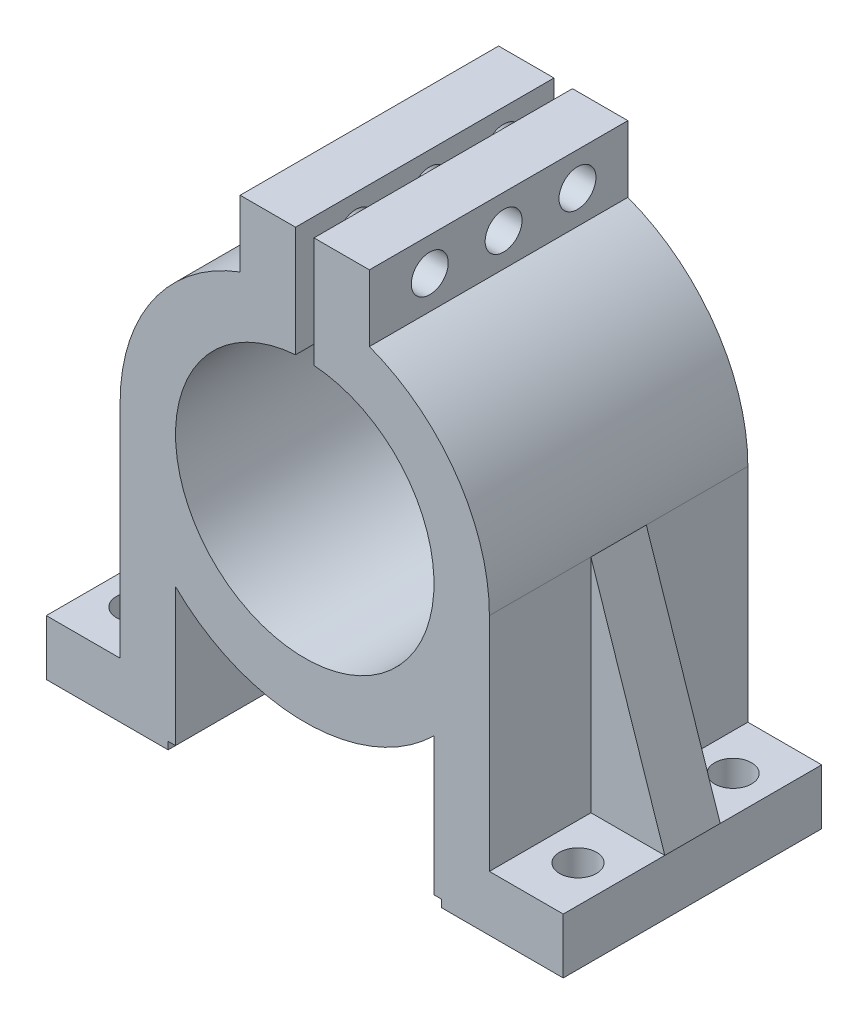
ISO-10303-21;
HEADER;
FILE_DESCRIPTION(('STEP AP214'),'2;1');
FILE_NAME('part.step','',(''),(''),'','','');
FILE_SCHEMA(('AUTOMOTIVE_DESIGN { 1 0 10303 214 1 1 1 1 }'));
ENDSEC;
DATA;
#1=APPLICATION_CONTEXT('core data for automotive mechanical design processes');
#2=APPLICATION_PROTOCOL_DEFINITION('international standard','automotive_design',2000,#1);
#3=PRODUCT_CONTEXT('',#1,'mechanical');
#4=PRODUCT('Part','Part','',(#3));
#5=PRODUCT_RELATED_PRODUCT_CATEGORY('part','',(#4));
#6=PRODUCT_DEFINITION_FORMATION('','',#4);
#7=PRODUCT_DEFINITION_CONTEXT('part definition',#1,'design');
#8=PRODUCT_DEFINITION('design','',#6,#7);
#9=PRODUCT_DEFINITION_SHAPE('','',#8);
#10=(LENGTH_UNIT() NAMED_UNIT(*) SI_UNIT(.MILLI.,.METRE.));
#11=(NAMED_UNIT(*) PLANE_ANGLE_UNIT() SI_UNIT($,.RADIAN.));
#12=(NAMED_UNIT(*) SI_UNIT($,.STERADIAN.) SOLID_ANGLE_UNIT());
#13=UNCERTAINTY_MEASURE_WITH_UNIT(LENGTH_MEASURE(1.E-05),#10,'distance_accuracy_value','');
#14=(GEOMETRIC_REPRESENTATION_CONTEXT(3) GLOBAL_UNCERTAINTY_ASSIGNED_CONTEXT((#13)) GLOBAL_UNIT_ASSIGNED_CONTEXT((#10,
#11,#12)) REPRESENTATION_CONTEXT('',''));
#15=CARTESIAN_POINT('',(0.,0.,0.));
#16=DIRECTION('',(0.,0.,1.));
#17=DIRECTION('',(1.,0.,0.));
#18=AXIS2_PLACEMENT_3D('',#15,#16,#17);
#19=CARTESIAN_POINT('',(10.,-12.,7.));
#20=DIRECTION('',(0.,-1.,0.));
#21=DIRECTION('',(0.,0.,-1.));
#22=AXIS2_PLACEMENT_3D('',#19,#20,#21);
#23=PLANE('',#22);
#24=CARTESIAN_POINT('',(12.,-12.,4.2));
#25=DIRECTION('',(0.,1.,0.));
#26=DIRECTION('',(0.,0.,-1.));
#27=AXIS2_PLACEMENT_3D('',#24,#25,#26);
#28=CIRCLE('',#27,1.);
#29=CARTESIAN_POINT('',(12.,-12.,3.2));
#30=VERTEX_POINT('',#29);
#31=EDGE_CURVE('E353',#30,#30,#28,.T.);
#32=ORIENTED_EDGE('',*,*,#31,.F.);
#33=EDGE_LOOP('',(#32));
#34=FACE_BOUND('',#33,.T.);
#35=DIRECTION('',(-1.,0.,0.));
#36=VECTOR('',#35,1.);
#37=CARTESIAN_POINT('',(10.,-12.,1.5));
#38=LINE('',#37,#36);
#39=CARTESIAN_POINT('',(14.,-12.,1.5));
#40=VERTEX_POINT('',#39);
#41=CARTESIAN_POINT('',(10.,-12.,1.5));
#42=VERTEX_POINT('',#41);
#43=EDGE_CURVE('E241',#40,#42,#38,.T.);
#44=ORIENTED_EDGE('',*,*,#43,.T.);
#45=DIRECTION('',(0.,0.,-1.));
#46=VECTOR('',#45,1.);
#47=CARTESIAN_POINT('',(10.,-12.,7.));
#48=LINE('',#47,#46);
#49=CARTESIAN_POINT('',(10.,-12.,7.));
#50=VERTEX_POINT('',#49);
#51=EDGE_CURVE('E253',#50,#42,#48,.T.);
#52=ORIENTED_EDGE('',*,*,#51,.F.);
#53=DIRECTION('',(-1.,0.,0.));
#54=VECTOR('',#53,1.);
#55=CARTESIAN_POINT('',(10.,-12.,7.));
#56=LINE('',#55,#54);
#57=CARTESIAN_POINT('',(14.,-12.,7.));
#58=VERTEX_POINT('',#57);
#59=EDGE_CURVE('E450',#58,#50,#56,.T.);
#60=ORIENTED_EDGE('',*,*,#59,.F.);
#61=DIRECTION('',(0.,0.,-1.));
#62=VECTOR('',#61,1.);
#63=CARTESIAN_POINT('',(14.,-12.,7.));
#64=LINE('',#63,#62);
#65=EDGE_CURVE('E256',#58,#40,#64,.T.);
#66=ORIENTED_EDGE('',*,*,#65,.T.);
#67=EDGE_LOOP('',(#44,#52,#60,#66));
#68=FACE_BOUND('',#67,.T.);
#69=ADVANCED_FACE('F39',(#34,#68),#23,.F.);
#70=CARTESIAN_POINT('',(10.,0.,7.));
#71=DIRECTION('',(-1.,0.,0.));
#72=DIRECTION('',(0.,0.,1.));
#73=AXIS2_PLACEMENT_3D('',#70,#71,#72);
#74=PLANE('',#73);
#75=DIRECTION('',(0.,1.,0.));
#76=VECTOR('',#75,1.);
#77=CARTESIAN_POINT('',(10.,0.,1.5));
#78=LINE('',#77,#76);
#79=CARTESIAN_POINT('',(10.,0.,1.5));
#80=VERTEX_POINT('',#79);
#81=EDGE_CURVE('E238',#42,#80,#78,.T.);
#82=ORIENTED_EDGE('',*,*,#81,.T.);
#83=DIRECTION('',(0.,0.,-1.));
#84=VECTOR('',#83,1.);
#85=CARTESIAN_POINT('',(10.,0.,7.));
#86=LINE('',#85,#84);
#87=CARTESIAN_POINT('',(10.,0.,7.));
#88=VERTEX_POINT('',#87);
#89=EDGE_CURVE('E264',#88,#80,#86,.T.);
#90=ORIENTED_EDGE('',*,*,#89,.F.);
#91=DIRECTION('',(0.,1.,0.));
#92=VECTOR('',#91,1.);
#93=CARTESIAN_POINT('',(10.,0.,7.));
#94=LINE('',#93,#92);
#95=EDGE_CURVE('E259',#50,#88,#94,.T.);
#96=ORIENTED_EDGE('',*,*,#95,.F.);
#97=ORIENTED_EDGE('',*,*,#51,.T.);
#98=EDGE_LOOP('',(#82,#90,#96,#97));
#99=FACE_BOUND('',#98,.T.);
#100=ADVANCED_FACE('F258',(#99),#74,.F.);
#101=CARTESIAN_POINT('',(-10.,0.,7.));
#102=DIRECTION('',(1.,0.,0.));
#103=DIRECTION('',(0.,0.,-1.));
#104=AXIS2_PLACEMENT_3D('',#101,#102,#103);
#105=PLANE('',#104);
#106=DIRECTION('',(0.,1.,0.));
#107=VECTOR('',#106,1.);
#108=CARTESIAN_POINT('',(-10.,0.,1.5));
#109=LINE('',#108,#107);
#110=CARTESIAN_POINT('',(-10.,-12.,1.5));
#111=VERTEX_POINT('',#110);
#112=CARTESIAN_POINT('',(-10.,0.,1.5));
#113=VERTEX_POINT('',#112);
#114=EDGE_CURVE('E389',#111,#113,#109,.T.);
#115=ORIENTED_EDGE('',*,*,#114,.F.);
#116=DIRECTION('',(0.,0.,-1.));
#117=VECTOR('',#116,1.);
#118=CARTESIAN_POINT('',(-10.,-12.,7.));
#119=LINE('',#118,#117);
#120=CARTESIAN_POINT('',(-10.,-12.,7.));
#121=VERTEX_POINT('',#120);
#122=EDGE_CURVE('E303',#121,#111,#119,.T.);
#123=ORIENTED_EDGE('',*,*,#122,.F.);
#124=DIRECTION('',(0.,-1.,0.));
#125=VECTOR('',#124,1.);
#126=CARTESIAN_POINT('',(-10.,0.,7.));
#127=LINE('',#126,#125);
#128=CARTESIAN_POINT('',(-10.,0.,7.));
#129=VERTEX_POINT('',#128);
#130=EDGE_CURVE('E424',#129,#121,#127,.T.);
#131=ORIENTED_EDGE('',*,*,#130,.F.);
#132=DIRECTION('',(0.,0.,-1.));
#133=VECTOR('',#132,1.);
#134=CARTESIAN_POINT('',(-10.,0.,7.));
#135=LINE('',#134,#133);
#136=EDGE_CURVE('E307',#129,#113,#135,.T.);
#137=ORIENTED_EDGE('',*,*,#136,.T.);
#138=EDGE_LOOP('',(#115,#123,#131,#137));
#139=FACE_BOUND('',#138,.T.);
#140=ADVANCED_FACE('F588',(#139),#105,.F.);
#141=CARTESIAN_POINT('',(-10.,-12.,7.));
#142=DIRECTION('',(0.,-1.,0.));
#143=DIRECTION('',(0.,0.,-1.));
#144=AXIS2_PLACEMENT_3D('',#141,#142,#143);
#145=PLANE('',#144);
#146=CARTESIAN_POINT('',(-12.,-12.,4.2));
#147=DIRECTION('',(0.,-1.,0.));
#148=DIRECTION('',(0.,0.,-1.));
#149=AXIS2_PLACEMENT_3D('',#146,#147,#148);
#150=CIRCLE('',#149,1.);
#151=CARTESIAN_POINT('',(-12.,-12.,3.2));
#152=VERTEX_POINT('',#151);
#153=EDGE_CURVE('E363',#152,#152,#150,.T.);
#154=ORIENTED_EDGE('',*,*,#153,.T.);
#155=EDGE_LOOP('',(#154));
#156=FACE_BOUND('',#155,.T.);
#157=DIRECTION('',(1.,0.,0.));
#158=VECTOR('',#157,1.);
#159=CARTESIAN_POINT('',(-10.,-12.,1.5));
#160=LINE('',#159,#158);
#161=CARTESIAN_POINT('',(-14.,-12.,1.5));
#162=VERTEX_POINT('',#161);
#163=EDGE_CURVE('E394',#162,#111,#160,.T.);
#164=ORIENTED_EDGE('',*,*,#163,.F.);
#165=DIRECTION('',(0.,0.,-1.));
#166=VECTOR('',#165,1.);
#167=CARTESIAN_POINT('',(-14.,-12.,7.));
#168=LINE('',#167,#166);
#169=CARTESIAN_POINT('',(-14.,-12.,7.));
#170=VERTEX_POINT('',#169);
#171=EDGE_CURVE('E299',#170,#162,#168,.T.);
#172=ORIENTED_EDGE('',*,*,#171,.F.);
#173=DIRECTION('',(-1.,0.,0.));
#174=VECTOR('',#173,1.);
#175=CARTESIAN_POINT('',(-10.,-12.,7.));
#176=LINE('',#175,#174);
#177=EDGE_CURVE('E426',#121,#170,#176,.T.);
#178=ORIENTED_EDGE('',*,*,#177,.F.);
#179=ORIENTED_EDGE('',*,*,#122,.T.);
#180=EDGE_LOOP('',(#164,#172,#178,#179));
#181=FACE_BOUND('',#180,.T.);
#182=ADVANCED_FACE('F591',(#156,#181),#145,.F.);
#183=CARTESIAN_POINT('',(0.5,12.9674969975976,7.));
#184=DIRECTION('',(0.,-1.,0.));
#185=DIRECTION('',(1.,0.,0.));
#186=AXIS2_PLACEMENT_3D('',#183,#184,#185);
#187=PLANE('',#186);
#188=DIRECTION('',(-1.,0.,0.));
#189=VECTOR('',#188,1.);
#190=CARTESIAN_POINT('',(0.5,12.9674969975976,-7.));
#191=LINE('',#190,#189);
#192=CARTESIAN_POINT('',(3.5,12.9674969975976,-7.));
#193=VERTEX_POINT('',#192);
#194=CARTESIAN_POINT('',(0.5,12.9674969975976,-7.));
#195=VERTEX_POINT('',#194);
#196=EDGE_CURVE('E407',#193,#195,#191,.T.);
#197=ORIENTED_EDGE('',*,*,#196,.T.);
#198=DIRECTION('',(0.,0.,-1.));
#199=VECTOR('',#198,1.);
#200=CARTESIAN_POINT('',(0.5,12.9674969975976,7.));
#201=LINE('',#200,#199);
#202=CARTESIAN_POINT('',(0.5,12.9674969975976,7.));
#203=VERTEX_POINT('',#202);
#204=EDGE_CURVE('E11',#203,#195,#201,.T.);
#205=ORIENTED_EDGE('',*,*,#204,.F.);
#206=DIRECTION('',(-1.,0.,0.));
#207=VECTOR('',#206,1.);
#208=CARTESIAN_POINT('',(0.5,12.9674969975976,7.));
#209=LINE('',#208,#207);
#210=CARTESIAN_POINT('',(3.5,12.9674969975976,7.));
#211=VERTEX_POINT('',#210);
#212=EDGE_CURVE('E408',#211,#203,#209,.T.);
#213=ORIENTED_EDGE('',*,*,#212,.F.);
#214=DIRECTION('',(0.,0.,-1.));
#215=VECTOR('',#214,1.);
#216=CARTESIAN_POINT('',(3.5,12.9674969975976,7.));
#217=LINE('',#216,#215);
#218=EDGE_CURVE('E457',#211,#193,#217,.T.);
#219=ORIENTED_EDGE('',*,*,#218,.T.);
#220=EDGE_LOOP('',(#197,#205,#213,#219));
#221=FACE_BOUND('',#220,.T.);
#222=ADVANCED_FACE('F41',(#221),#187,.F.);
#223=CARTESIAN_POINT('',(0.5,6.98212002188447,7.));
#224=DIRECTION('',(1.,0.,0.));
#225=DIRECTION('',(0.,0.,-1.));
#226=AXIS2_PLACEMENT_3D('',#223,#224,#225);
#227=PLANE('',#226);
#228=CARTESIAN_POINT('',(0.5,11.1674969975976,-4.27112111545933));
#229=DIRECTION('',(1.,0.,0.));
#230=DIRECTION('',(0.,0.,-1.));
#231=AXIS2_PLACEMENT_3D('',#228,#229,#230);
#232=CIRCLE('',#231,1.);
#233=CARTESIAN_POINT('',(0.5,11.1674969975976,-5.27112111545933));
#234=VERTEX_POINT('',#233);
#235=EDGE_CURVE('E350',#234,#234,#232,.T.);
#236=ORIENTED_EDGE('',*,*,#235,.T.);
#237=EDGE_LOOP('',(#236));
#238=FACE_BOUND('',#237,.T.);
#239=CARTESIAN_POINT('',(0.5,11.1674969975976,-0.271121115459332));
#240=DIRECTION('',(1.,0.,0.));
#241=DIRECTION('',(0.,0.,-1.));
#242=AXIS2_PLACEMENT_3D('',#239,#240,#241);
#243=CIRCLE('',#242,1.);
#244=CARTESIAN_POINT('',(0.5,11.1674969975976,-1.27112111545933));
#245=VERTEX_POINT('',#244);
#246=EDGE_CURVE('E335',#245,#245,#243,.T.);
#247=ORIENTED_EDGE('',*,*,#246,.T.);
#248=EDGE_LOOP('',(#247));
#249=FACE_BOUND('',#248,.T.);
#250=CARTESIAN_POINT('',(0.5,11.1674969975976,3.72887888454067));
#251=DIRECTION('',(1.,0.,0.));
#252=DIRECTION('',(0.,0.,-1.));
#253=AXIS2_PLACEMENT_3D('',#250,#251,#252);
#254=CIRCLE('',#253,1.);
#255=CARTESIAN_POINT('',(0.5,11.1674969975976,2.72887888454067));
#256=VERTEX_POINT('',#255);
#257=EDGE_CURVE('E331',#256,#256,#254,.T.);
#258=ORIENTED_EDGE('',*,*,#257,.T.);
#259=EDGE_LOOP('',(#258));
#260=FACE_BOUND('',#259,.T.);
#261=DIRECTION('',(0.,-1.,0.));
#262=VECTOR('',#261,1.);
#263=CARTESIAN_POINT('',(0.5,6.98212002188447,-7.));
#264=LINE('',#263,#262);
#265=CARTESIAN_POINT('',(0.5,6.98212002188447,-7.));
#266=VERTEX_POINT('',#265);
#267=EDGE_CURVE('E460',#195,#266,#264,.T.);
#268=ORIENTED_EDGE('',*,*,#267,.T.);
#269=DIRECTION('',(0.,0.,-1.));
#270=VECTOR('',#269,1.);
#271=CARTESIAN_POINT('',(0.5,6.98212002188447,7.));
#272=LINE('',#271,#270);
#273=CARTESIAN_POINT('',(0.5,6.98212002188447,7.));
#274=VERTEX_POINT('',#273);
#275=EDGE_CURVE('E48',#274,#266,#272,.T.);
#276=ORIENTED_EDGE('',*,*,#275,.F.);
#277=DIRECTION('',(0.,-1.,0.));
#278=VECTOR('',#277,1.);
#279=CARTESIAN_POINT('',(0.5,6.98212002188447,7.));
#280=LINE('',#279,#278);
#281=EDGE_CURVE('E411',#203,#274,#280,.T.);
#282=ORIENTED_EDGE('',*,*,#281,.F.);
#283=ORIENTED_EDGE('',*,*,#204,.T.);
#284=EDGE_LOOP('',(#268,#276,#282,#283));
#285=FACE_BOUND('',#284,.T.);
#286=ADVANCED_FACE('F557',(#238,#249,#260,#285),#227,.F.);
#287=CARTESIAN_POINT('',(0.,0.,7.));
#288=DIRECTION('',(0.,0.,-1.));
#289=DIRECTION('',(-1.,0.,0.));
#290=AXIS2_PLACEMENT_3D('',#287,#288,#289);
#291=CYLINDRICAL_SURFACE('',#290,7.);
#292=CARTESIAN_POINT('',(0.,0.,-7.));
#293=DIRECTION('',(0.,0.,-1.));
#294=DIRECTION('',(1.,0.,0.));
#295=AXIS2_PLACEMENT_3D('',#292,#293,#294);
#296=CIRCLE('',#295,7.);
#297=CARTESIAN_POINT('',(-0.5,6.98212002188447,-7.));
#298=VERTEX_POINT('',#297);
#299=EDGE_CURVE('E462',#266,#298,#296,.T.);
#300=ORIENTED_EDGE('',*,*,#299,.T.);
#301=DIRECTION('',(0.,0.,-1.));
#302=VECTOR('',#301,1.);
#303=CARTESIAN_POINT('',(-0.5,6.98212002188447,7.));
#304=LINE('',#303,#302);
#305=CARTESIAN_POINT('',(-0.5,6.98212002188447,7.));
#306=VERTEX_POINT('',#305);
#307=EDGE_CURVE('E319',#306,#298,#304,.T.);
#308=ORIENTED_EDGE('',*,*,#307,.F.);
#309=CARTESIAN_POINT('',(0.,0.,7.));
#310=DIRECTION('',(0.,0.,-1.));
#311=DIRECTION('',(1.,0.,0.));
#312=AXIS2_PLACEMENT_3D('',#309,#310,#311);
#313=CIRCLE('',#312,7.);
#314=EDGE_CURVE('E414',#274,#306,#313,.T.);
#315=ORIENTED_EDGE('',*,*,#314,.F.);
#316=ORIENTED_EDGE('',*,*,#275,.T.);
#317=EDGE_LOOP('',(#300,#308,#315,#316));
#318=FACE_BOUND('',#317,.T.);
#319=ADVANCED_FACE('F560',(#318),#291,.F.);
#320=CARTESIAN_POINT('',(-0.5,6.98212002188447,7.));
#321=DIRECTION('',(-1.,0.,0.));
#322=DIRECTION('',(0.,0.,1.));
#323=AXIS2_PLACEMENT_3D('',#320,#321,#322);
#324=PLANE('',#323);
#325=CARTESIAN_POINT('',(-0.5,11.1674969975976,-4.27112111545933));
#326=DIRECTION('',(-1.,0.,0.));
#327=DIRECTION('',(0.,0.,1.));
#328=AXIS2_PLACEMENT_3D('',#325,#326,#327);
#329=CIRCLE('',#328,1.);
#330=CARTESIAN_POINT('',(-0.5,11.1674969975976,-3.27112111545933));
#331=VERTEX_POINT('',#330);
#332=EDGE_CURVE('E347',#331,#331,#329,.T.);
#333=ORIENTED_EDGE('',*,*,#332,.T.);
#334=EDGE_LOOP('',(#333));
#335=FACE_BOUND('',#334,.T.);
#336=CARTESIAN_POINT('',(-0.5,11.1674969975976,-0.271121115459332));
#337=DIRECTION('',(-1.,0.,0.));
#338=DIRECTION('',(0.,0.,1.));
#339=AXIS2_PLACEMENT_3D('',#336,#337,#338);
#340=CIRCLE('',#339,1.);
#341=CARTESIAN_POINT('',(-0.5,11.1674969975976,0.728878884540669));
#342=VERTEX_POINT('',#341);
#343=EDGE_CURVE('E330',#342,#342,#340,.T.);
#344=ORIENTED_EDGE('',*,*,#343,.T.);
#345=EDGE_LOOP('',(#344));
#346=FACE_BOUND('',#345,.T.);
#347=CARTESIAN_POINT('',(-0.5,11.1674969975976,3.72887888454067));
#348=DIRECTION('',(-1.,0.,0.));
#349=DIRECTION('',(0.,0.,1.));
#350=AXIS2_PLACEMENT_3D('',#347,#348,#349);
#351=CIRCLE('',#350,1.);
#352=CARTESIAN_POINT('',(-0.5,11.1674969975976,4.72887888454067));
#353=VERTEX_POINT('',#352);
#354=EDGE_CURVE('E326',#353,#353,#351,.T.);
#355=ORIENTED_EDGE('',*,*,#354,.T.);
#356=EDGE_LOOP('',(#355));
#357=FACE_BOUND('',#356,.T.);
#358=DIRECTION('',(0.,1.,0.));
#359=VECTOR('',#358,1.);
#360=CARTESIAN_POINT('',(-0.5,6.98212002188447,-7.));
#361=LINE('',#360,#359);
#362=CARTESIAN_POINT('',(-0.5,12.9674969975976,-7.));
#363=VERTEX_POINT('',#362);
#364=EDGE_CURVE('E464',#298,#363,#361,.T.);
#365=ORIENTED_EDGE('',*,*,#364,.T.);
#366=DIRECTION('',(0.,0.,-1.));
#367=VECTOR('',#366,1.);
#368=CARTESIAN_POINT('',(-0.5,12.9674969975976,7.));
#369=LINE('',#368,#367);
#370=CARTESIAN_POINT('',(-0.5,12.9674969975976,7.));
#371=VERTEX_POINT('',#370);
#372=EDGE_CURVE('E316',#371,#363,#369,.T.);
#373=ORIENTED_EDGE('',*,*,#372,.F.);
#374=DIRECTION('',(0.,1.,0.));
#375=VECTOR('',#374,1.);
#376=CARTESIAN_POINT('',(-0.5,6.98212002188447,7.));
#377=LINE('',#376,#375);
#378=EDGE_CURVE('E416',#306,#371,#377,.T.);
#379=ORIENTED_EDGE('',*,*,#378,.F.);
#380=ORIENTED_EDGE('',*,*,#307,.T.);
#381=EDGE_LOOP('',(#365,#373,#379,#380));
#382=FACE_BOUND('',#381,.T.);
#383=ADVANCED_FACE('F565',(#335,#346,#357,#382),#324,.F.);
#384=CARTESIAN_POINT('',(-3.5,12.9674969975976,7.));
#385=DIRECTION('',(0.,-1.,0.));
#386=DIRECTION('',(0.,0.,-1.));
#387=AXIS2_PLACEMENT_3D('',#384,#385,#386);
#388=PLANE('',#387);
#389=DIRECTION('',(-1.,0.,0.));
#390=VECTOR('',#389,1.);
#391=CARTESIAN_POINT('',(-3.5,12.9674969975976,-7.));
#392=LINE('',#391,#390);
#393=CARTESIAN_POINT('',(-3.5,12.9674969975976,-7.));
#394=VERTEX_POINT('',#393);
#395=EDGE_CURVE('E466',#363,#394,#392,.T.);
#396=ORIENTED_EDGE('',*,*,#395,.T.);
#397=DIRECTION('',(0.,0.,-1.));
#398=VECTOR('',#397,1.);
#399=CARTESIAN_POINT('',(-3.5,12.9674969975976,7.));
#400=LINE('',#399,#398);
#401=CARTESIAN_POINT('',(-3.5,12.9674969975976,7.));
#402=VERTEX_POINT('',#401);
#403=EDGE_CURVE('E313',#402,#394,#400,.T.);
#404=ORIENTED_EDGE('',*,*,#403,.F.);
#405=DIRECTION('',(-1.,0.,0.));
#406=VECTOR('',#405,1.);
#407=CARTESIAN_POINT('',(-3.5,12.9674969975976,7.));
#408=LINE('',#407,#406);
#409=EDGE_CURVE('E418',#371,#402,#408,.T.);
#410=ORIENTED_EDGE('',*,*,#409,.F.);
#411=ORIENTED_EDGE('',*,*,#372,.T.);
#412=EDGE_LOOP('',(#396,#404,#410,#411));
#413=FACE_BOUND('',#412,.T.);
#414=ADVANCED_FACE('F571',(#413),#388,.F.);
#415=CARTESIAN_POINT('',(-3.5,9.3674969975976,7.));
#416=DIRECTION('',(1.,0.,0.));
#417=DIRECTION('',(0.,0.,-1.));
#418=AXIS2_PLACEMENT_3D('',#415,#416,#417);
#419=PLANE('',#418);
#420=CARTESIAN_POINT('',(-3.5,11.1674969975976,-4.27112111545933));
#421=DIRECTION('',(-1.,0.,0.));
#422=DIRECTION('',(0.,0.,1.));
#423=AXIS2_PLACEMENT_3D('',#420,#421,#422);
#424=CIRCLE('',#423,1.);
#425=CARTESIAN_POINT('',(-3.5,11.1674969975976,-3.27112111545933));
#426=VERTEX_POINT('',#425);
#427=EDGE_CURVE('E327',#426,#426,#424,.T.);
#428=ORIENTED_EDGE('',*,*,#427,.F.);
#429=EDGE_LOOP('',(#428));
#430=FACE_BOUND('',#429,.T.);
#431=CARTESIAN_POINT('',(-3.5,11.1674969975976,-0.271121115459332));
#432=DIRECTION('',(-1.,0.,0.));
#433=DIRECTION('',(0.,0.,1.));
#434=AXIS2_PLACEMENT_3D('',#431,#432,#433);
#435=CIRCLE('',#434,1.);
#436=CARTESIAN_POINT('',(-3.5,11.1674969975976,0.728878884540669));
#437=VERTEX_POINT('',#436);
#438=EDGE_CURVE('E1071',#437,#437,#435,.T.);
#439=ORIENTED_EDGE('',*,*,#438,.F.);
#440=EDGE_LOOP('',(#439));
#441=FACE_BOUND('',#440,.T.);
#442=CARTESIAN_POINT('',(-3.5,11.1674969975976,3.72887888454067));
#443=DIRECTION('',(-1.,0.,0.));
#444=DIRECTION('',(0.,0.,1.));
#445=AXIS2_PLACEMENT_3D('',#442,#443,#444);
#446=CIRCLE('',#445,1.);
#447=CARTESIAN_POINT('',(-3.5,11.1674969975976,4.72887888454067));
#448=VERTEX_POINT('',#447);
#449=EDGE_CURVE('E1074',#448,#448,#446,.T.);
#450=ORIENTED_EDGE('',*,*,#449,.F.);
#451=EDGE_LOOP('',(#450));
#452=FACE_BOUND('',#451,.T.);
#453=DIRECTION('',(0.,-1.,0.));
#454=VECTOR('',#453,1.);
#455=CARTESIAN_POINT('',(-3.5,9.3674969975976,-7.));
#456=LINE('',#455,#454);
#457=CARTESIAN_POINT('',(-3.5,9.3674969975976,-7.));
#458=VERTEX_POINT('',#457);
#459=EDGE_CURVE('E468',#394,#458,#456,.T.);
#460=ORIENTED_EDGE('',*,*,#459,.T.);
#461=DIRECTION('',(0.,0.,-1.));
#462=VECTOR('',#461,1.);
#463=CARTESIAN_POINT('',(-3.5,9.3674969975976,7.));
#464=LINE('',#463,#462);
#465=CARTESIAN_POINT('',(-3.5,9.3674969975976,7.));
#466=VERTEX_POINT('',#465);
#467=EDGE_CURVE('E310',#466,#458,#464,.T.);
#468=ORIENTED_EDGE('',*,*,#467,.F.);
#469=DIRECTION('',(0.,-1.,0.));
#470=VECTOR('',#469,1.);
#471=CARTESIAN_POINT('',(-3.5,9.3674969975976,7.));
#472=LINE('',#471,#470);
#473=EDGE_CURVE('E420',#402,#466,#472,.T.);
#474=ORIENTED_EDGE('',*,*,#473,.F.);
#475=ORIENTED_EDGE('',*,*,#403,.T.);
#476=EDGE_LOOP('',(#460,#468,#474,#475));
#477=FACE_BOUND('',#476,.T.);
#478=ADVANCED_FACE('F575',(#430,#441,#452,#477),#419,.F.);
#479=CARTESIAN_POINT('',(0.,0.,7.));
#480=DIRECTION('',(0.,0.,-1.));
#481=DIRECTION('',(-1.,0.,0.));
#482=AXIS2_PLACEMENT_3D('',#479,#480,#481);
#483=CYLINDRICAL_SURFACE('',#482,10.);
#484=CARTESIAN_POINT('',(0.,0.,-7.));
#485=DIRECTION('',(0.,0.,1.));
#486=DIRECTION('',(1.,0.,0.));
#487=AXIS2_PLACEMENT_3D('',#484,#485,#486);
#488=CIRCLE('',#487,10.);
#489=CARTESIAN_POINT('',(-10.,0.,-7.));
#490=VERTEX_POINT('',#489);
#491=EDGE_CURVE('E470',#458,#490,#488,.T.);
#492=ORIENTED_EDGE('',*,*,#491,.T.);
#493=CARTESIAN_POINT('',(-10.,0.,-1.5));
#494=VERTEX_POINT('',#493);
#495=EDGE_CURVE('E306',#494,#490,#135,.T.);
#496=ORIENTED_EDGE('',*,*,#495,.F.);
#497=DIRECTION('',(0.,0.,-1.));
#498=VECTOR('',#497,1.);
#499=CARTESIAN_POINT('',(-10.,0.,1.5));
#500=LINE('',#499,#498);
#501=EDGE_CURVE('E404',#113,#494,#500,.T.);
#502=ORIENTED_EDGE('',*,*,#501,.F.);
#503=ORIENTED_EDGE('',*,*,#136,.F.);
#504=CARTESIAN_POINT('',(0.,0.,7.));
#505=DIRECTION('',(0.,0.,1.));
#506=DIRECTION('',(1.,0.,0.));
#507=AXIS2_PLACEMENT_3D('',#504,#505,#506);
#508=CIRCLE('',#507,10.);
#509=EDGE_CURVE('E422',#466,#129,#508,.T.);
#510=ORIENTED_EDGE('',*,*,#509,.F.);
#511=ORIENTED_EDGE('',*,*,#467,.T.);
#512=EDGE_LOOP('',(#492,#496,#502,#503,#510,#511));
#513=FACE_BOUND('',#512,.T.);
#514=ADVANCED_FACE('F580',(#513),#483,.T.);
#515=CARTESIAN_POINT('',(-10.,-12.,-1.5));
#516=VERTEX_POINT('',#515);
#517=CARTESIAN_POINT('',(-10.,-12.,-7.));
#518=VERTEX_POINT('',#517);
#519=EDGE_CURVE('E302',#516,#518,#119,.T.);
#520=ORIENTED_EDGE('',*,*,#519,.F.);
#521=DIRECTION('',(0.,1.,0.));
#522=VECTOR('',#521,1.);
#523=CARTESIAN_POINT('',(-10.,0.,-1.5));
#524=LINE('',#523,#522);
#525=EDGE_CURVE('E388',#516,#494,#524,.T.);
#526=ORIENTED_EDGE('',*,*,#525,.T.);
#527=ORIENTED_EDGE('',*,*,#495,.T.);
#528=DIRECTION('',(0.,-1.,0.));
#529=VECTOR('',#528,1.);
#530=CARTESIAN_POINT('',(-10.,0.,-7.));
#531=LINE('',#530,#529);
#532=EDGE_CURVE('E473',#490,#518,#531,.T.);
#533=ORIENTED_EDGE('',*,*,#532,.T.);
#534=EDGE_LOOP('',(#520,#526,#527,#533));
#535=FACE_BOUND('',#534,.T.);
#536=ADVANCED_FACE('F649',(#535),#105,.F.);
#537=CARTESIAN_POINT('',(-12.,-12.,-4.2));
#538=DIRECTION('',(0.,1.,0.));
#539=DIRECTION('',(0.,0.,1.));
#540=AXIS2_PLACEMENT_3D('',#537,#538,#539);
#541=CIRCLE('',#540,1.);
#542=CARTESIAN_POINT('',(-12.,-12.,-3.2));
#543=VERTEX_POINT('',#542);
#544=EDGE_CURVE('E369',#543,#543,#541,.T.);
#545=ORIENTED_EDGE('',*,*,#544,.F.);
#546=EDGE_LOOP('',(#545));
#547=FACE_BOUND('',#546,.T.);
#548=CARTESIAN_POINT('',(-14.,-12.,-1.5));
#549=VERTEX_POINT('',#548);
#550=CARTESIAN_POINT('',(-14.,-12.,-7.));
#551=VERTEX_POINT('',#550);
#552=EDGE_CURVE('E298',#549,#551,#168,.T.);
#553=ORIENTED_EDGE('',*,*,#552,.F.);
#554=DIRECTION('',(1.,0.,0.));
#555=VECTOR('',#554,1.);
#556=CARTESIAN_POINT('',(-10.,-12.,-1.5));
#557=LINE('',#556,#555);
#558=EDGE_CURVE('E64',#549,#516,#557,.T.);
#559=ORIENTED_EDGE('',*,*,#558,.T.);
#560=ORIENTED_EDGE('',*,*,#519,.T.);
#561=DIRECTION('',(-1.,0.,0.));
#562=VECTOR('',#561,1.);
#563=CARTESIAN_POINT('',(-10.,-12.,-7.));
#564=LINE('',#563,#562);
#565=EDGE_CURVE('E476',#518,#551,#564,.T.);
#566=ORIENTED_EDGE('',*,*,#565,.T.);
#567=EDGE_LOOP('',(#553,#559,#560,#566));
#568=FACE_BOUND('',#567,.T.);
#569=ADVANCED_FACE('F646',(#547,#568),#145,.F.);
#570=CARTESIAN_POINT('',(-14.,-12.,7.));
#571=DIRECTION('',(1.,0.,0.));
#572=DIRECTION('',(0.,1.,0.));
#573=AXIS2_PLACEMENT_3D('',#570,#571,#572);
#574=PLANE('',#573);
#575=DIRECTION('',(0.,-1.,0.));
#576=VECTOR('',#575,1.);
#577=CARTESIAN_POINT('',(-14.,-12.,-7.));
#578=LINE('',#577,#576);
#579=CARTESIAN_POINT('',(-14.,-15.,-7.));
#580=VERTEX_POINT('',#579);
#581=EDGE_CURVE('E479',#551,#580,#578,.T.);
#582=ORIENTED_EDGE('',*,*,#581,.T.);
#583=DIRECTION('',(0.,0.,-1.));
#584=VECTOR('',#583,1.);
#585=CARTESIAN_POINT('',(-14.,-15.,7.));
#586=LINE('',#585,#584);
#587=CARTESIAN_POINT('',(-14.,-15.,7.));
#588=VERTEX_POINT('',#587);
#589=EDGE_CURVE('E295',#588,#580,#586,.T.);
#590=ORIENTED_EDGE('',*,*,#589,.F.);
#591=DIRECTION('',(0.,-1.,0.));
#592=VECTOR('',#591,1.);
#593=CARTESIAN_POINT('',(-14.,-12.,7.));
#594=LINE('',#593,#592);
#595=EDGE_CURVE('E428',#170,#588,#594,.T.);
#596=ORIENTED_EDGE('',*,*,#595,.F.);
#597=ORIENTED_EDGE('',*,*,#171,.T.);
#598=DIRECTION('',(0.,0.,-1.));
#599=VECTOR('',#598,1.);
#600=CARTESIAN_POINT('',(-14.,-12.,1.5));
#601=LINE('',#600,#599);
#602=EDGE_CURVE('E396',#162,#549,#601,.T.);
#603=ORIENTED_EDGE('',*,*,#602,.T.);
#604=ORIENTED_EDGE('',*,*,#552,.T.);
#605=EDGE_LOOP('',(#582,#590,#596,#597,#603,#604));
#606=FACE_BOUND('',#605,.T.);
#607=ADVANCED_FACE('F595',(#606),#574,.F.);
#608=CARTESIAN_POINT('',(-14.,-15.,7.));
#609=DIRECTION('',(0.,1.,0.));
#610=DIRECTION('',(-1.,0.,0.));
#611=AXIS2_PLACEMENT_3D('',#608,#609,#610);
#612=PLANE('',#611);
#613=CARTESIAN_POINT('',(-12.,-15.,4.2));
#614=DIRECTION('',(0.,-1.,0.));
#615=DIRECTION('',(0.,0.,-1.));
#616=AXIS2_PLACEMENT_3D('',#613,#614,#615);
#617=CIRCLE('',#616,1.);
#618=CARTESIAN_POINT('',(-12.,-15.,3.2));
#619=VERTEX_POINT('',#618);
#620=EDGE_CURVE('E366',#619,#619,#617,.T.);
#621=ORIENTED_EDGE('',*,*,#620,.F.);
#622=EDGE_LOOP('',(#621));
#623=FACE_BOUND('',#622,.T.);
#624=CARTESIAN_POINT('',(-12.,-15.,-4.2));
#625=DIRECTION('',(0.,1.,0.));
#626=DIRECTION('',(0.,0.,1.));
#627=AXIS2_PLACEMENT_3D('',#624,#625,#626);
#628=CIRCLE('',#627,1.);
#629=CARTESIAN_POINT('',(-12.,-15.,-3.2));
#630=VERTEX_POINT('',#629);
#631=EDGE_CURVE('E372',#630,#630,#628,.T.);
#632=ORIENTED_EDGE('',*,*,#631,.T.);
#633=EDGE_LOOP('',(#632));
#634=FACE_BOUND('',#633,.T.);
#635=DIRECTION('',(1.,0.,0.));
#636=VECTOR('',#635,1.);
#637=CARTESIAN_POINT('',(-14.,-15.,-7.));
#638=LINE('',#637,#636);
#639=CARTESIAN_POINT('',(-7.4,-15.,-7.));
#640=VERTEX_POINT('',#639);
#641=EDGE_CURVE('E481',#580,#640,#638,.T.);
#642=ORIENTED_EDGE('',*,*,#641,.T.);
#643=DIRECTION('',(0.,0.,-1.));
#644=VECTOR('',#643,1.);
#645=CARTESIAN_POINT('',(-7.4,-15.,7.));
#646=LINE('',#645,#644);
#647=CARTESIAN_POINT('',(-7.4,-15.,7.));
#648=VERTEX_POINT('',#647);
#649=EDGE_CURVE('E292',#648,#640,#646,.T.);
#650=ORIENTED_EDGE('',*,*,#649,.F.);
#651=DIRECTION('',(1.,0.,0.));
#652=VECTOR('',#651,1.);
#653=CARTESIAN_POINT('',(-14.,-15.,7.));
#654=LINE('',#653,#652);
#655=EDGE_CURVE('E430',#588,#648,#654,.T.);
#656=ORIENTED_EDGE('',*,*,#655,.F.);
#657=ORIENTED_EDGE('',*,*,#589,.T.);
#658=EDGE_LOOP('',(#642,#650,#656,#657));
#659=FACE_BOUND('',#658,.T.);
#660=ADVANCED_FACE('F601',(#623,#634,#659),#612,.F.);
#661=CARTESIAN_POINT('',(-7.4,-15.,7.));
#662=DIRECTION('',(-1.,0.,0.));
#663=DIRECTION('',(0.,0.,1.));
#664=AXIS2_PLACEMENT_3D('',#661,#662,#663);
#665=PLANE('',#664);
#666=DIRECTION('',(0.,1.,0.));
#667=VECTOR('',#666,1.);
#668=CARTESIAN_POINT('',(-7.4,-15.,-7.));
#669=LINE('',#668,#667);
#670=CARTESIAN_POINT('',(-7.4,-14.6,-7.));
#671=VERTEX_POINT('',#670);
#672=EDGE_CURVE('E483',#640,#671,#669,.T.);
#673=ORIENTED_EDGE('',*,*,#672,.T.);
#674=DIRECTION('',(0.,0.,-1.));
#675=VECTOR('',#674,1.);
#676=CARTESIAN_POINT('',(-7.4,-14.6,7.));
#677=LINE('',#676,#675);
#678=CARTESIAN_POINT('',(-7.4,-14.6,7.));
#679=VERTEX_POINT('',#678);
#680=EDGE_CURVE('E289',#679,#671,#677,.T.);
#681=ORIENTED_EDGE('',*,*,#680,.F.);
#682=DIRECTION('',(0.,1.,0.));
#683=VECTOR('',#682,1.);
#684=CARTESIAN_POINT('',(-7.4,-15.,7.));
#685=LINE('',#684,#683);
#686=EDGE_CURVE('E432',#648,#679,#685,.T.);
#687=ORIENTED_EDGE('',*,*,#686,.F.);
#688=ORIENTED_EDGE('',*,*,#649,.T.);
#689=EDGE_LOOP('',(#673,#681,#687,#688));
#690=FACE_BOUND('',#689,.T.);
#691=ADVANCED_FACE('F605',(#690),#665,.F.);
#692=CARTESIAN_POINT('',(-7.4,-14.6,7.));
#693=DIRECTION('',(0.,1.,0.));
#694=DIRECTION('',(0.,0.,1.));
#695=AXIS2_PLACEMENT_3D('',#692,#693,#694);
#696=PLANE('',#695);
#697=DIRECTION('',(1.,0.,0.));
#698=VECTOR('',#697,1.);
#699=CARTESIAN_POINT('',(-7.4,-14.6,-7.));
#700=LINE('',#699,#698);
#701=CARTESIAN_POINT('',(-7.,-14.6,-7.));
#702=VERTEX_POINT('',#701);
#703=EDGE_CURVE('E485',#671,#702,#700,.T.);
#704=ORIENTED_EDGE('',*,*,#703,.T.);
#705=DIRECTION('',(0.,0.,-1.));
#706=VECTOR('',#705,1.);
#707=CARTESIAN_POINT('',(-7.,-14.6,7.));
#708=LINE('',#707,#706);
#709=CARTESIAN_POINT('',(-7.,-14.6,7.));
#710=VERTEX_POINT('',#709);
#711=EDGE_CURVE('E286',#710,#702,#708,.T.);
#712=ORIENTED_EDGE('',*,*,#711,.F.);
#713=DIRECTION('',(1.,0.,0.));
#714=VECTOR('',#713,1.);
#715=CARTESIAN_POINT('',(-7.4,-14.6,7.));
#716=LINE('',#715,#714);
#717=EDGE_CURVE('E434',#679,#710,#716,.T.);
#718=ORIENTED_EDGE('',*,*,#717,.F.);
#719=ORIENTED_EDGE('',*,*,#680,.T.);
#720=EDGE_LOOP('',(#704,#712,#718,#719));
#721=FACE_BOUND('',#720,.T.);
#722=ADVANCED_FACE('F610',(#721),#696,.F.);
#723=CARTESIAN_POINT('',(-7.,-14.6,7.));
#724=DIRECTION('',(-1.,0.,0.));
#725=DIRECTION('',(0.,-1.,0.));
#726=AXIS2_PLACEMENT_3D('',#723,#724,#725);
#727=PLANE('',#726);
#728=DIRECTION('',(0.,1.,0.));
#729=VECTOR('',#728,1.);
#730=CARTESIAN_POINT('',(-7.,-14.6,-7.));
#731=LINE('',#730,#729);
#732=CARTESIAN_POINT('',(-7.,-7.14142842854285,-7.));
#733=VERTEX_POINT('',#732);
#734=EDGE_CURVE('E487',#702,#733,#731,.T.);
#735=ORIENTED_EDGE('',*,*,#734,.T.);
#736=DIRECTION('',(0.,0.,-1.));
#737=VECTOR('',#736,1.);
#738=CARTESIAN_POINT('',(-7.,-7.14142842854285,7.));
#739=LINE('',#738,#737);
#740=CARTESIAN_POINT('',(-7.,-7.14142842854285,7.));
#741=VERTEX_POINT('',#740);
#742=EDGE_CURVE('E283',#741,#733,#739,.T.);
#743=ORIENTED_EDGE('',*,*,#742,.F.);
#744=DIRECTION('',(0.,1.,0.));
#745=VECTOR('',#744,1.);
#746=CARTESIAN_POINT('',(-7.,-14.6,7.));
#747=LINE('',#746,#745);
#748=EDGE_CURVE('E436',#710,#741,#747,.T.);
#749=ORIENTED_EDGE('',*,*,#748,.F.);
#750=ORIENTED_EDGE('',*,*,#711,.T.);
#751=EDGE_LOOP('',(#735,#743,#749,#750));
#752=FACE_BOUND('',#751,.T.);
#753=ADVANCED_FACE('F616',(#752),#727,.F.);
#754=CARTESIAN_POINT('',(0.,0.,7.));
#755=DIRECTION('',(0.,0.,-1.));
#756=DIRECTION('',(-1.,0.,0.));
#757=AXIS2_PLACEMENT_3D('',#754,#755,#756);
#758=CYLINDRICAL_SURFACE('',#757,10.);
#759=CARTESIAN_POINT('',(0.,0.,-7.));
#760=DIRECTION('',(0.,0.,1.));
#761=DIRECTION('',(1.,0.,0.));
#762=AXIS2_PLACEMENT_3D('',#759,#760,#761);
#763=CIRCLE('',#762,10.);
#764=CARTESIAN_POINT('',(7.,-7.14142842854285,-7.));
#765=VERTEX_POINT('',#764);
#766=EDGE_CURVE('E489',#733,#765,#763,.T.);
#767=ORIENTED_EDGE('',*,*,#766,.T.);
#768=DIRECTION('',(0.,0.,-1.));
#769=VECTOR('',#768,1.);
#770=CARTESIAN_POINT('',(7.,-7.14142842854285,7.));
#771=LINE('',#770,#769);
#772=CARTESIAN_POINT('',(7.,-7.14142842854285,7.));
#773=VERTEX_POINT('',#772);
#774=EDGE_CURVE('E280',#773,#765,#771,.T.);
#775=ORIENTED_EDGE('',*,*,#774,.F.);
#776=CARTESIAN_POINT('',(0.,0.,7.));
#777=DIRECTION('',(0.,0.,1.));
#778=DIRECTION('',(1.,0.,0.));
#779=AXIS2_PLACEMENT_3D('',#776,#777,#778);
#780=CIRCLE('',#779,10.);
#781=EDGE_CURVE('E438',#741,#773,#780,.T.);
#782=ORIENTED_EDGE('',*,*,#781,.F.);
#783=ORIENTED_EDGE('',*,*,#742,.T.);
#784=EDGE_LOOP('',(#767,#775,#782,#783));
#785=FACE_BOUND('',#784,.T.);
#786=ADVANCED_FACE('F620',(#785),#758,.T.);
#787=CARTESIAN_POINT('',(7.,-14.6,7.));
#788=DIRECTION('',(1.,0.,0.));
#789=DIRECTION('',(0.,1.,0.));
#790=AXIS2_PLACEMENT_3D('',#787,#788,#789);
#791=PLANE('',#790);
#792=DIRECTION('',(0.,-1.,0.));
#793=VECTOR('',#792,1.);
#794=CARTESIAN_POINT('',(7.,-14.6,-7.));
#795=LINE('',#794,#793);
#796=CARTESIAN_POINT('',(7.,-14.6,-7.));
#797=VERTEX_POINT('',#796);
#798=EDGE_CURVE('E491',#765,#797,#795,.T.);
#799=ORIENTED_EDGE('',*,*,#798,.T.);
#800=DIRECTION('',(0.,0.,-1.));
#801=VECTOR('',#800,1.);
#802=CARTESIAN_POINT('',(7.,-14.6,7.));
#803=LINE('',#802,#801);
#804=CARTESIAN_POINT('',(7.,-14.6,7.));
#805=VERTEX_POINT('',#804);
#806=EDGE_CURVE('E277',#805,#797,#803,.T.);
#807=ORIENTED_EDGE('',*,*,#806,.F.);
#808=DIRECTION('',(0.,-1.,0.));
#809=VECTOR('',#808,1.);
#810=CARTESIAN_POINT('',(7.,-14.6,7.));
#811=LINE('',#810,#809);
#812=EDGE_CURVE('E440',#773,#805,#811,.T.);
#813=ORIENTED_EDGE('',*,*,#812,.F.);
#814=ORIENTED_EDGE('',*,*,#774,.T.);
#815=EDGE_LOOP('',(#799,#807,#813,#814));
#816=FACE_BOUND('',#815,.T.);
#817=ADVANCED_FACE('F625',(#816),#791,.F.);
#818=CARTESIAN_POINT('',(7.4,-14.6,7.));
#819=DIRECTION('',(0.,1.,0.));
#820=DIRECTION('',(-1.,0.,0.));
#821=AXIS2_PLACEMENT_3D('',#818,#819,#820);
#822=PLANE('',#821);
#823=DIRECTION('',(1.,0.,0.));
#824=VECTOR('',#823,1.);
#825=CARTESIAN_POINT('',(7.4,-14.6,-7.));
#826=LINE('',#825,#824);
#827=CARTESIAN_POINT('',(7.4,-14.6,-7.));
#828=VERTEX_POINT('',#827);
#829=EDGE_CURVE('E493',#797,#828,#826,.T.);
#830=ORIENTED_EDGE('',*,*,#829,.T.);
#831=DIRECTION('',(0.,0.,-1.));
#832=VECTOR('',#831,1.);
#833=CARTESIAN_POINT('',(7.4,-14.6,7.));
#834=LINE('',#833,#832);
#835=CARTESIAN_POINT('',(7.4,-14.6,7.));
#836=VERTEX_POINT('',#835);
#837=EDGE_CURVE('E274',#836,#828,#834,.T.);
#838=ORIENTED_EDGE('',*,*,#837,.F.);
#839=DIRECTION('',(1.,0.,0.));
#840=VECTOR('',#839,1.);
#841=CARTESIAN_POINT('',(7.4,-14.6,7.));
#842=LINE('',#841,#840);
#843=EDGE_CURVE('E442',#805,#836,#842,.T.);
#844=ORIENTED_EDGE('',*,*,#843,.F.);
#845=ORIENTED_EDGE('',*,*,#806,.T.);
#846=EDGE_LOOP('',(#830,#838,#844,#845));
#847=FACE_BOUND('',#846,.T.);
#848=ADVANCED_FACE('F631',(#847),#822,.F.);
#849=CARTESIAN_POINT('',(7.4,-15.,7.));
#850=DIRECTION('',(1.,0.,0.));
#851=DIRECTION('',(0.,0.,-1.));
#852=AXIS2_PLACEMENT_3D('',#849,#850,#851);
#853=PLANE('',#852);
#854=DIRECTION('',(0.,-1.,0.));
#855=VECTOR('',#854,1.);
#856=CARTESIAN_POINT('',(7.4,-15.,-7.));
#857=LINE('',#856,#855);
#858=CARTESIAN_POINT('',(7.4,-15.,-7.));
#859=VERTEX_POINT('',#858);
#860=EDGE_CURVE('E495',#828,#859,#857,.T.);
#861=ORIENTED_EDGE('',*,*,#860,.T.);
#862=DIRECTION('',(0.,0.,-1.));
#863=VECTOR('',#862,1.);
#864=CARTESIAN_POINT('',(7.4,-15.,7.));
#865=LINE('',#864,#863);
#866=CARTESIAN_POINT('',(7.4,-15.,7.));
#867=VERTEX_POINT('',#866);
#868=EDGE_CURVE('E271',#867,#859,#865,.T.);
#869=ORIENTED_EDGE('',*,*,#868,.F.);
#870=DIRECTION('',(0.,-1.,0.));
#871=VECTOR('',#870,1.);
#872=CARTESIAN_POINT('',(7.4,-15.,7.));
#873=LINE('',#872,#871);
#874=EDGE_CURVE('E444',#836,#867,#873,.T.);
#875=ORIENTED_EDGE('',*,*,#874,.F.);
#876=ORIENTED_EDGE('',*,*,#837,.T.);
#877=EDGE_LOOP('',(#861,#869,#875,#876));
#878=FACE_BOUND('',#877,.T.);
#879=ADVANCED_FACE('F635',(#878),#853,.F.);
#880=CARTESIAN_POINT('',(14.,-15.,7.));
#881=DIRECTION('',(0.,1.,0.));
#882=DIRECTION('',(-1.,0.,0.));
#883=AXIS2_PLACEMENT_3D('',#880,#881,#882);
#884=PLANE('',#883);
#885=CARTESIAN_POINT('',(12.,-15.,4.2));
#886=DIRECTION('',(0.,1.,0.));
#887=DIRECTION('',(0.,0.,-1.));
#888=AXIS2_PLACEMENT_3D('',#885,#886,#887);
#889=CIRCLE('',#888,1.);
#890=CARTESIAN_POINT('',(12.,-15.,3.2));
#891=VERTEX_POINT('',#890);
#892=EDGE_CURVE('E354',#891,#891,#889,.T.);
#893=ORIENTED_EDGE('',*,*,#892,.T.);
#894=EDGE_LOOP('',(#893));
#895=FACE_BOUND('',#894,.T.);
#896=CARTESIAN_POINT('',(12.,-15.,-4.2));
#897=DIRECTION('',(0.,-1.,0.));
#898=DIRECTION('',(0.,0.,1.));
#899=AXIS2_PLACEMENT_3D('',#896,#897,#898);
#900=CIRCLE('',#899,1.);
#901=CARTESIAN_POINT('',(12.,-15.,-3.2));
#902=VERTEX_POINT('',#901);
#903=EDGE_CURVE('E360',#902,#902,#900,.T.);
#904=ORIENTED_EDGE('',*,*,#903,.F.);
#905=EDGE_LOOP('',(#904));
#906=FACE_BOUND('',#905,.T.);
#907=DIRECTION('',(1.,0.,0.));
#908=VECTOR('',#907,1.);
#909=CARTESIAN_POINT('',(14.,-15.,-7.));
#910=LINE('',#909,#908);
#911=CARTESIAN_POINT('',(14.,-15.,-7.));
#912=VERTEX_POINT('',#911);
#913=EDGE_CURVE('E497',#859,#912,#910,.T.);
#914=ORIENTED_EDGE('',*,*,#913,.T.);
#915=DIRECTION('',(0.,0.,-1.));
#916=VECTOR('',#915,1.);
#917=CARTESIAN_POINT('',(14.,-15.,7.));
#918=LINE('',#917,#916);
#919=CARTESIAN_POINT('',(14.,-15.,7.));
#920=VERTEX_POINT('',#919);
#921=EDGE_CURVE('E268',#920,#912,#918,.T.);
#922=ORIENTED_EDGE('',*,*,#921,.F.);
#923=DIRECTION('',(1.,0.,0.));
#924=VECTOR('',#923,1.);
#925=CARTESIAN_POINT('',(14.,-15.,7.));
#926=LINE('',#925,#924);
#927=EDGE_CURVE('E446',#867,#920,#926,.T.);
#928=ORIENTED_EDGE('',*,*,#927,.F.);
#929=ORIENTED_EDGE('',*,*,#868,.T.);
#930=EDGE_LOOP('',(#914,#922,#928,#929));
#931=FACE_BOUND('',#930,.T.);
#932=ADVANCED_FACE('F638',(#895,#906,#931),#884,.F.);
#933=CARTESIAN_POINT('',(14.,-12.,7.));
#934=DIRECTION('',(-1.,0.,0.));
#935=DIRECTION('',(0.,0.,1.));
#936=AXIS2_PLACEMENT_3D('',#933,#934,#935);
#937=PLANE('',#936);
#938=DIRECTION('',(0.,1.,0.));
#939=VECTOR('',#938,1.);
#940=CARTESIAN_POINT('',(14.,-12.,-7.));
#941=LINE('',#940,#939);
#942=CARTESIAN_POINT('',(14.,-12.,-7.));
#943=VERTEX_POINT('',#942);
#944=EDGE_CURVE('E499',#912,#943,#941,.T.);
#945=ORIENTED_EDGE('',*,*,#944,.T.);
#946=CARTESIAN_POINT('',(14.,-12.,-1.5));
#947=VERTEX_POINT('',#946);
#948=EDGE_CURVE('E260',#947,#943,#64,.T.);
#949=ORIENTED_EDGE('',*,*,#948,.F.);
#950=DIRECTION('',(0.,0.,-1.));
#951=VECTOR('',#950,1.);
#952=CARTESIAN_POINT('',(14.,-12.,1.5));
#953=LINE('',#952,#951);
#954=EDGE_CURVE('E386',#40,#947,#953,.T.);
#955=ORIENTED_EDGE('',*,*,#954,.F.);
#956=ORIENTED_EDGE('',*,*,#65,.F.);
#957=DIRECTION('',(0.,1.,0.));
#958=VECTOR('',#957,1.);
#959=CARTESIAN_POINT('',(14.,-12.,7.));
#960=LINE('',#959,#958);
#961=EDGE_CURVE('E448',#920,#58,#960,.T.);
#962=ORIENTED_EDGE('',*,*,#961,.F.);
#963=ORIENTED_EDGE('',*,*,#921,.T.);
#964=EDGE_LOOP('',(#945,#949,#955,#956,#962,#963));
#965=FACE_BOUND('',#964,.T.);
#966=ADVANCED_FACE('F531',(#965),#937,.F.);
#967=CARTESIAN_POINT('',(12.,-12.,-4.2));
#968=DIRECTION('',(0.,-1.,0.));
#969=DIRECTION('',(0.,0.,1.));
#970=AXIS2_PLACEMENT_3D('',#967,#968,#969);
#971=CIRCLE('',#970,1.);
#972=CARTESIAN_POINT('',(12.,-12.,-3.2));
#973=VERTEX_POINT('',#972);
#974=EDGE_CURVE('E357',#973,#973,#971,.T.);
#975=ORIENTED_EDGE('',*,*,#974,.T.);
#976=EDGE_LOOP('',(#975));
#977=FACE_BOUND('',#976,.T.);
#978=CARTESIAN_POINT('',(10.,-12.,-1.5));
#979=VERTEX_POINT('',#978);
#980=CARTESIAN_POINT('',(10.,-12.,-7.));
#981=VERTEX_POINT('',#980);
#982=EDGE_CURVE('E261',#979,#981,#48,.T.);
#983=ORIENTED_EDGE('',*,*,#982,.F.);
#984=DIRECTION('',(-1.,0.,0.));
#985=VECTOR('',#984,1.);
#986=CARTESIAN_POINT('',(10.,-12.,-1.5));
#987=LINE('',#986,#985);
#988=EDGE_CURVE('E381',#947,#979,#987,.T.);
#989=ORIENTED_EDGE('',*,*,#988,.F.);
#990=ORIENTED_EDGE('',*,*,#948,.T.);
#991=DIRECTION('',(-1.,0.,0.));
#992=VECTOR('',#991,1.);
#993=CARTESIAN_POINT('',(10.,-12.,-7.));
#994=LINE('',#993,#992);
#995=EDGE_CURVE('E502',#943,#981,#994,.T.);
#996=ORIENTED_EDGE('',*,*,#995,.T.);
#997=EDGE_LOOP('',(#983,#989,#990,#996));
#998=FACE_BOUND('',#997,.T.);
#999=ADVANCED_FACE('F540',(#977,#998),#23,.F.);
#1000=CARTESIAN_POINT('',(10.,0.,-1.5));
#1001=VERTEX_POINT('',#1000);
#1002=CARTESIAN_POINT('',(10.,0.,-7.));
#1003=VERTEX_POINT('',#1002);
#1004=EDGE_CURVE('E514',#1001,#1003,#86,.T.);
#1005=ORIENTED_EDGE('',*,*,#1004,.F.);
#1006=DIRECTION('',(0.,1.,0.));
#1007=VECTOR('',#1006,1.);
#1008=CARTESIAN_POINT('',(10.,0.,-1.5));
#1009=LINE('',#1008,#1007);
#1010=EDGE_CURVE('E375',#979,#1001,#1009,.T.);
#1011=ORIENTED_EDGE('',*,*,#1010,.F.);
#1012=ORIENTED_EDGE('',*,*,#982,.T.);
#1013=DIRECTION('',(0.,1.,0.));
#1014=VECTOR('',#1013,1.);
#1015=CARTESIAN_POINT('',(10.,0.,-7.));
#1016=LINE('',#1015,#1014);
#1017=EDGE_CURVE('E505',#981,#1003,#1016,.T.);
#1018=ORIENTED_EDGE('',*,*,#1017,.T.);
#1019=EDGE_LOOP('',(#1005,#1011,#1012,#1018));
#1020=FACE_BOUND('',#1019,.T.);
#1021=ADVANCED_FACE('F544',(#1020),#74,.F.);
#1022=CARTESIAN_POINT('',(0.,0.,7.));
#1023=DIRECTION('',(0.,0.,-1.));
#1024=DIRECTION('',(-1.,0.,0.));
#1025=AXIS2_PLACEMENT_3D('',#1022,#1023,#1024);
#1026=CYLINDRICAL_SURFACE('',#1025,10.);
#1027=CARTESIAN_POINT('',(0.,0.,-7.));
#1028=DIRECTION('',(0.,0.,1.));
#1029=DIRECTION('',(1.,0.,0.));
#1030=AXIS2_PLACEMENT_3D('',#1027,#1028,#1029);
#1031=CIRCLE('',#1030,10.);
#1032=CARTESIAN_POINT('',(3.5,9.3674969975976,-7.));
#1033=VERTEX_POINT('',#1032);
#1034=EDGE_CURVE('E508',#1003,#1033,#1031,.T.);
#1035=ORIENTED_EDGE('',*,*,#1034,.T.);
#1036=DIRECTION('',(0.,0.,-1.));
#1037=VECTOR('',#1036,1.);
#1038=CARTESIAN_POINT('',(3.5,9.3674969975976,7.));
#1039=LINE('',#1038,#1037);
#1040=CARTESIAN_POINT('',(3.5,9.3674969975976,7.));
#1041=VERTEX_POINT('',#1040);
#1042=EDGE_CURVE('E512',#1041,#1033,#1039,.T.);
#1043=ORIENTED_EDGE('',*,*,#1042,.F.);
#1044=CARTESIAN_POINT('',(0.,0.,7.));
#1045=DIRECTION('',(0.,0.,1.));
#1046=DIRECTION('',(1.,0.,0.));
#1047=AXIS2_PLACEMENT_3D('',#1044,#1045,#1046);
#1048=CIRCLE('',#1047,10.);
#1049=EDGE_CURVE('E453',#88,#1041,#1048,.T.);
#1050=ORIENTED_EDGE('',*,*,#1049,.F.);
#1051=ORIENTED_EDGE('',*,*,#89,.T.);
#1052=DIRECTION('',(0.,0.,-1.));
#1053=VECTOR('',#1052,1.);
#1054=CARTESIAN_POINT('',(10.,0.,1.5));
#1055=LINE('',#1054,#1053);
#1056=EDGE_CURVE('E379',#80,#1001,#1055,.T.);
#1057=ORIENTED_EDGE('',*,*,#1056,.T.);
#1058=ORIENTED_EDGE('',*,*,#1004,.T.);
#1059=EDGE_LOOP('',(#1035,#1043,#1050,#1051,#1057,#1058));
#1060=FACE_BOUND('',#1059,.T.);
#1061=ADVANCED_FACE('F522',(#1060),#1026,.T.);
#1062=CARTESIAN_POINT('',(3.5,12.9674969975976,7.));
#1063=DIRECTION('',(-1.,0.,0.));
#1064=DIRECTION('',(0.,-1.,0.));
#1065=AXIS2_PLACEMENT_3D('',#1062,#1063,#1064);
#1066=PLANE('',#1065);
#1067=CARTESIAN_POINT('',(3.5,11.1674969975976,-4.27112111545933));
#1068=DIRECTION('',(-1.,0.,0.));
#1069=DIRECTION('',(0.,-1.,0.));
#1070=AXIS2_PLACEMENT_3D('',#1067,#1068,#1069);
#1071=CIRCLE('',#1070,1.);
#1072=CARTESIAN_POINT('',(3.5,10.1674969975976,-4.27112111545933));
#1073=VERTEX_POINT('',#1072);
#1074=EDGE_CURVE('E43',#1073,#1073,#1071,.T.);
#1075=ORIENTED_EDGE('',*,*,#1074,.T.);
#1076=EDGE_LOOP('',(#1075));
#1077=FACE_BOUND('',#1076,.T.);
#1078=CARTESIAN_POINT('',(3.5,11.1674969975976,-0.271121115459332));
#1079=DIRECTION('',(-1.,0.,0.));
#1080=DIRECTION('',(0.,-1.,0.));
#1081=AXIS2_PLACEMENT_3D('',#1078,#1079,#1080);
#1082=CIRCLE('',#1081,1.);
#1083=CARTESIAN_POINT('',(3.5,10.1674969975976,-0.271121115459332));
#1084=VERTEX_POINT('',#1083);
#1085=EDGE_CURVE('E328',#1084,#1084,#1082,.T.);
#1086=ORIENTED_EDGE('',*,*,#1085,.T.);
#1087=EDGE_LOOP('',(#1086));
#1088=FACE_BOUND('',#1087,.T.);
#1089=CARTESIAN_POINT('',(3.5,11.1674969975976,3.72887888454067));
#1090=DIRECTION('',(-1.,0.,0.));
#1091=DIRECTION('',(0.,-1.,0.));
#1092=AXIS2_PLACEMENT_3D('',#1089,#1090,#1091);
#1093=CIRCLE('',#1092,1.);
#1094=CARTESIAN_POINT('',(3.5,10.1674969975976,3.72887888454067));
#1095=VERTEX_POINT('',#1094);
#1096=EDGE_CURVE('E324',#1095,#1095,#1093,.T.);
#1097=ORIENTED_EDGE('',*,*,#1096,.T.);
#1098=EDGE_LOOP('',(#1097));
#1099=FACE_BOUND('',#1098,.T.);
#1100=DIRECTION('',(0.,1.,0.));
#1101=VECTOR('',#1100,1.);
#1102=CARTESIAN_POINT('',(3.5,12.9674969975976,-7.));
#1103=LINE('',#1102,#1101);
#1104=EDGE_CURVE('E412',#1033,#193,#1103,.T.);
#1105=ORIENTED_EDGE('',*,*,#1104,.T.);
#1106=ORIENTED_EDGE('',*,*,#218,.F.);
#1107=DIRECTION('',(0.,1.,0.));
#1108=VECTOR('',#1107,1.);
#1109=CARTESIAN_POINT('',(3.5,12.9674969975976,7.));
#1110=LINE('',#1109,#1108);
#1111=EDGE_CURVE('E455',#1041,#211,#1110,.T.);
#1112=ORIENTED_EDGE('',*,*,#1111,.F.);
#1113=ORIENTED_EDGE('',*,*,#1042,.T.);
#1114=EDGE_LOOP('',(#1105,#1106,#1112,#1113));
#1115=FACE_BOUND('',#1114,.T.);
#1116=ADVANCED_FACE('F549',(#1077,#1088,#1099,#1115),#1066,.F.);
#1117=CARTESIAN_POINT('',(0.,0.,7.));
#1118=DIRECTION('',(0.,0.,1.));
#1119=DIRECTION('',(1.,0.,0.));
#1120=AXIS2_PLACEMENT_3D('',#1117,#1118,#1119);
#1121=PLANE('',#1120);
#1122=ORIENTED_EDGE('',*,*,#212,.T.);
#1123=ORIENTED_EDGE('',*,*,#281,.T.);
#1124=ORIENTED_EDGE('',*,*,#314,.T.);
#1125=ORIENTED_EDGE('',*,*,#378,.T.);
#1126=ORIENTED_EDGE('',*,*,#409,.T.);
#1127=ORIENTED_EDGE('',*,*,#473,.T.);
#1128=ORIENTED_EDGE('',*,*,#509,.T.);
#1129=ORIENTED_EDGE('',*,*,#130,.T.);
#1130=ORIENTED_EDGE('',*,*,#177,.T.);
#1131=ORIENTED_EDGE('',*,*,#595,.T.);
#1132=ORIENTED_EDGE('',*,*,#655,.T.);
#1133=ORIENTED_EDGE('',*,*,#686,.T.);
#1134=ORIENTED_EDGE('',*,*,#717,.T.);
#1135=ORIENTED_EDGE('',*,*,#748,.T.);
#1136=ORIENTED_EDGE('',*,*,#781,.T.);
#1137=ORIENTED_EDGE('',*,*,#812,.T.);
#1138=ORIENTED_EDGE('',*,*,#843,.T.);
#1139=ORIENTED_EDGE('',*,*,#874,.T.);
#1140=ORIENTED_EDGE('',*,*,#927,.T.);
#1141=ORIENTED_EDGE('',*,*,#961,.T.);
#1142=ORIENTED_EDGE('',*,*,#59,.T.);
#1143=ORIENTED_EDGE('',*,*,#95,.T.);
#1144=ORIENTED_EDGE('',*,*,#1049,.T.);
#1145=ORIENTED_EDGE('',*,*,#1111,.T.);
#1146=EDGE_LOOP('',(#1122,#1123,#1124,#1125,#1126,#1127,#1128,#1129,#1130,#1131,#1132,#1133,
#1134,#1135,#1136,#1137,#1138,#1139,#1140,#1141,#1142,#1143,#1144,#1145));
#1147=FACE_BOUND('',#1146,.T.);
#1148=ADVANCED_FACE('F524',(#1147),#1121,.T.);
#1149=CARTESIAN_POINT('',(0.,0.,-7.));
#1150=DIRECTION('',(0.,0.,1.));
#1151=DIRECTION('',(1.,0.,0.));
#1152=AXIS2_PLACEMENT_3D('',#1149,#1150,#1151);
#1153=PLANE('',#1152);
#1154=ORIENTED_EDGE('',*,*,#196,.F.);
#1155=ORIENTED_EDGE('',*,*,#1104,.F.);
#1156=ORIENTED_EDGE('',*,*,#1034,.F.);
#1157=ORIENTED_EDGE('',*,*,#1017,.F.);
#1158=ORIENTED_EDGE('',*,*,#995,.F.);
#1159=ORIENTED_EDGE('',*,*,#944,.F.);
#1160=ORIENTED_EDGE('',*,*,#913,.F.);
#1161=ORIENTED_EDGE('',*,*,#860,.F.);
#1162=ORIENTED_EDGE('',*,*,#829,.F.);
#1163=ORIENTED_EDGE('',*,*,#798,.F.);
#1164=ORIENTED_EDGE('',*,*,#766,.F.);
#1165=ORIENTED_EDGE('',*,*,#734,.F.);
#1166=ORIENTED_EDGE('',*,*,#703,.F.);
#1167=ORIENTED_EDGE('',*,*,#672,.F.);
#1168=ORIENTED_EDGE('',*,*,#641,.F.);
#1169=ORIENTED_EDGE('',*,*,#581,.F.);
#1170=ORIENTED_EDGE('',*,*,#565,.F.);
#1171=ORIENTED_EDGE('',*,*,#532,.F.);
#1172=ORIENTED_EDGE('',*,*,#491,.F.);
#1173=ORIENTED_EDGE('',*,*,#459,.F.);
#1174=ORIENTED_EDGE('',*,*,#395,.F.);
#1175=ORIENTED_EDGE('',*,*,#364,.F.);
#1176=ORIENTED_EDGE('',*,*,#299,.F.);
#1177=ORIENTED_EDGE('',*,*,#267,.F.);
#1178=EDGE_LOOP('',(#1154,#1155,#1156,#1157,#1158,#1159,#1160,#1161,#1162,#1163,#1164,#1165,
#1166,#1167,#1168,#1169,#1170,#1171,#1172,#1173,#1174,#1175,#1176,#1177));
#1179=FACE_BOUND('',#1178,.T.);
#1180=ADVANCED_FACE('F548',(#1179),#1153,.F.);
#1181=CARTESIAN_POINT('',(-14.,-12.,1.5));
#1182=DIRECTION('',(0.948683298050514,-0.316227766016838,0.));
#1183=DIRECTION('',(0.316227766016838,0.948683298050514,0.));
#1184=AXIS2_PLACEMENT_3D('',#1181,#1182,#1183);
#1185=PLANE('',#1184);
#1186=DIRECTION('',(-0.316227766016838,-0.948683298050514,0.));
#1187=VECTOR('',#1186,1.);
#1188=CARTESIAN_POINT('',(-14.,-12.,-1.5));
#1189=LINE('',#1188,#1187);
#1190=EDGE_CURVE('E399',#494,#549,#1189,.T.);
#1191=ORIENTED_EDGE('',*,*,#1190,.T.);
#1192=ORIENTED_EDGE('',*,*,#602,.F.);
#1193=DIRECTION('',(-0.316227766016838,-0.948683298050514,0.));
#1194=VECTOR('',#1193,1.);
#1195=CARTESIAN_POINT('',(-14.,-12.,1.5));
#1196=LINE('',#1195,#1194);
#1197=EDGE_CURVE('E392',#113,#162,#1196,.T.);
#1198=ORIENTED_EDGE('',*,*,#1197,.F.);
#1199=ORIENTED_EDGE('',*,*,#501,.T.);
#1200=EDGE_LOOP('',(#1191,#1192,#1198,#1199));
#1201=FACE_BOUND('',#1200,.T.);
#1202=ADVANCED_FACE('F652',(#1201),#1185,.F.);
#1203=CARTESIAN_POINT('',(0.,0.,1.5));
#1204=DIRECTION('',(0.,0.,-1.));
#1205=DIRECTION('',(-1.,0.,0.));
#1206=AXIS2_PLACEMENT_3D('',#1203,#1204,#1205);
#1207=PLANE('',#1206);
#1208=ORIENTED_EDGE('',*,*,#114,.T.);
#1209=ORIENTED_EDGE('',*,*,#1197,.T.);
#1210=ORIENTED_EDGE('',*,*,#163,.T.);
#1211=EDGE_LOOP('',(#1208,#1209,#1210));
#1212=FACE_BOUND('',#1211,.T.);
#1213=ADVANCED_FACE('F655',(#1212),#1207,.F.);
#1214=CARTESIAN_POINT('',(0.,0.,-1.5));
#1215=DIRECTION('',(0.,0.,-1.));
#1216=DIRECTION('',(-1.,0.,0.));
#1217=AXIS2_PLACEMENT_3D('',#1214,#1215,#1216);
#1218=PLANE('',#1217);
#1219=ORIENTED_EDGE('',*,*,#525,.F.);
#1220=ORIENTED_EDGE('',*,*,#558,.F.);
#1221=ORIENTED_EDGE('',*,*,#1190,.F.);
#1222=EDGE_LOOP('',(#1219,#1220,#1221));
#1223=FACE_BOUND('',#1222,.T.);
#1224=ADVANCED_FACE('F653',(#1223),#1218,.T.);
#1225=CARTESIAN_POINT('',(14.,-12.,1.5));
#1226=DIRECTION('',(0.948683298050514,0.316227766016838,0.));
#1227=DIRECTION('',(-0.316227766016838,0.948683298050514,0.));
#1228=AXIS2_PLACEMENT_3D('',#1225,#1226,#1227);
#1229=PLANE('',#1228);
#1230=DIRECTION('',(0.316227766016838,-0.948683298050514,0.));
#1231=VECTOR('',#1230,1.);
#1232=CARTESIAN_POINT('',(14.,-12.,-1.5));
#1233=LINE('',#1232,#1231);
#1234=EDGE_CURVE('E56',#1001,#947,#1233,.T.);
#1235=ORIENTED_EDGE('',*,*,#1234,.F.);
#1236=ORIENTED_EDGE('',*,*,#1056,.F.);
#1237=DIRECTION('',(0.316227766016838,-0.948683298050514,0.));
#1238=VECTOR('',#1237,1.);
#1239=CARTESIAN_POINT('',(14.,-12.,1.5));
#1240=LINE('',#1239,#1238);
#1241=EDGE_CURVE('E243',#80,#40,#1240,.T.);
#1242=ORIENTED_EDGE('',*,*,#1241,.T.);
#1243=ORIENTED_EDGE('',*,*,#954,.T.);
#1244=EDGE_LOOP('',(#1235,#1236,#1242,#1243));
#1245=FACE_BOUND('',#1244,.T.);
#1246=ADVANCED_FACE('F533',(#1245),#1229,.T.);
#1247=CARTESIAN_POINT('',(0.,0.,1.5));
#1248=DIRECTION('',(0.,0.,-1.));
#1249=DIRECTION('',(1.,0.,0.));
#1250=AXIS2_PLACEMENT_3D('',#1247,#1248,#1249);
#1251=PLANE('',#1250);
#1252=ORIENTED_EDGE('',*,*,#81,.F.);
#1253=ORIENTED_EDGE('',*,*,#43,.F.);
#1254=ORIENTED_EDGE('',*,*,#1241,.F.);
#1255=EDGE_LOOP('',(#1252,#1253,#1254));
#1256=FACE_BOUND('',#1255,.T.);
#1257=ADVANCED_FACE('F240',(#1256),#1251,.F.);
#1258=CARTESIAN_POINT('',(0.,0.,-1.5));
#1259=DIRECTION('',(0.,0.,-1.));
#1260=DIRECTION('',(1.,0.,0.));
#1261=AXIS2_PLACEMENT_3D('',#1258,#1259,#1260);
#1262=PLANE('',#1261);
#1263=ORIENTED_EDGE('',*,*,#1010,.T.);
#1264=ORIENTED_EDGE('',*,*,#1234,.T.);
#1265=ORIENTED_EDGE('',*,*,#988,.T.);
#1266=EDGE_LOOP('',(#1263,#1264,#1265));
#1267=FACE_BOUND('',#1266,.T.);
#1268=ADVANCED_FACE('F536',(#1267),#1262,.T.);
#1269=CARTESIAN_POINT('',(-12.,-15.,-4.2));
#1270=DIRECTION('',(0.,1.,0.));
#1271=DIRECTION('',(0.,0.,1.));
#1272=AXIS2_PLACEMENT_3D('',#1269,#1270,#1271);
#1273=CYLINDRICAL_SURFACE('',#1272,1.);
#1274=ORIENTED_EDGE('',*,*,#631,.F.);
#1275=EDGE_LOOP('',(#1274));
#1276=FACE_BOUND('',#1275,.T.);
#1277=ORIENTED_EDGE('',*,*,#544,.T.);
#1278=EDGE_LOOP('',(#1277));
#1279=FACE_BOUND('',#1278,.T.);
#1280=ADVANCED_FACE('F696',(#1276,#1279),#1273,.F.);
#1281=CARTESIAN_POINT('',(-12.,-15.,4.2));
#1282=DIRECTION('',(0.,1.,0.));
#1283=DIRECTION('',(0.,0.,1.));
#1284=AXIS2_PLACEMENT_3D('',#1281,#1282,#1283);
#1285=CYLINDRICAL_SURFACE('',#1284,1.);
#1286=ORIENTED_EDGE('',*,*,#620,.T.);
#1287=EDGE_LOOP('',(#1286));
#1288=FACE_BOUND('',#1287,.T.);
#1289=ORIENTED_EDGE('',*,*,#153,.F.);
#1290=EDGE_LOOP('',(#1289));
#1291=FACE_BOUND('',#1290,.T.);
#1292=ADVANCED_FACE('F687',(#1288,#1291),#1285,.F.);
#1293=CARTESIAN_POINT('',(12.,-15.,-4.2));
#1294=DIRECTION('',(0.,1.,0.));
#1295=DIRECTION('',(0.,0.,1.));
#1296=AXIS2_PLACEMENT_3D('',#1293,#1294,#1295);
#1297=CYLINDRICAL_SURFACE('',#1296,1.);
#1298=ORIENTED_EDGE('',*,*,#903,.T.);
#1299=EDGE_LOOP('',(#1298));
#1300=FACE_BOUND('',#1299,.T.);
#1301=ORIENTED_EDGE('',*,*,#974,.F.);
#1302=EDGE_LOOP('',(#1301));
#1303=FACE_BOUND('',#1302,.T.);
#1304=ADVANCED_FACE('F685',(#1300,#1303),#1297,.F.);
#1305=CARTESIAN_POINT('',(12.,-15.,4.2));
#1306=DIRECTION('',(0.,1.,0.));
#1307=DIRECTION('',(0.,0.,1.));
#1308=AXIS2_PLACEMENT_3D('',#1305,#1306,#1307);
#1309=CYLINDRICAL_SURFACE('',#1308,1.);
#1310=ORIENTED_EDGE('',*,*,#892,.F.);
#1311=EDGE_LOOP('',(#1310));
#1312=FACE_BOUND('',#1311,.T.);
#1313=ORIENTED_EDGE('',*,*,#31,.T.);
#1314=EDGE_LOOP('',(#1313));
#1315=FACE_BOUND('',#1314,.T.);
#1316=ADVANCED_FACE('F686',(#1312,#1315),#1309,.F.);
#1317=CARTESIAN_POINT('',(14.,11.1674969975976,3.72887888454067));
#1318=DIRECTION('',(-1.,0.,0.));
#1319=DIRECTION('',(0.,0.,1.));
#1320=AXIS2_PLACEMENT_3D('',#1317,#1318,#1319);
#1321=CYLINDRICAL_SURFACE('',#1320,1.);
#1322=ORIENTED_EDGE('',*,*,#1096,.F.);
#1323=EDGE_LOOP('',(#1322));
#1324=FACE_BOUND('',#1323,.T.);
#1325=ORIENTED_EDGE('',*,*,#257,.F.);
#1326=EDGE_LOOP('',(#1325));
#1327=FACE_BOUND('',#1326,.T.);
#1328=ADVANCED_FACE('F693',(#1324,#1327),#1321,.F.);
#1329=CARTESIAN_POINT('',(14.,11.1674969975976,-0.271121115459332));
#1330=DIRECTION('',(-1.,0.,0.));
#1331=DIRECTION('',(0.,0.,1.));
#1332=AXIS2_PLACEMENT_3D('',#1329,#1330,#1331);
#1333=CYLINDRICAL_SURFACE('',#1332,1.);
#1334=ORIENTED_EDGE('',*,*,#1085,.F.);
#1335=EDGE_LOOP('',(#1334));
#1336=FACE_BOUND('',#1335,.T.);
#1337=ORIENTED_EDGE('',*,*,#246,.F.);
#1338=EDGE_LOOP('',(#1337));
#1339=FACE_BOUND('',#1338,.T.);
#1340=ADVANCED_FACE('F770',(#1336,#1339),#1333,.F.);
#1341=CARTESIAN_POINT('',(14.,11.1674969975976,-4.27112111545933));
#1342=DIRECTION('',(-1.,0.,0.));
#1343=DIRECTION('',(0.,0.,1.));
#1344=AXIS2_PLACEMENT_3D('',#1341,#1342,#1343);
#1345=CYLINDRICAL_SURFACE('',#1344,1.);
#1346=ORIENTED_EDGE('',*,*,#1074,.F.);
#1347=EDGE_LOOP('',(#1346));
#1348=FACE_BOUND('',#1347,.T.);
#1349=ORIENTED_EDGE('',*,*,#235,.F.);
#1350=EDGE_LOOP('',(#1349));
#1351=FACE_BOUND('',#1350,.T.);
#1352=ADVANCED_FACE('F781',(#1348,#1351),#1345,.F.);
#1353=ORIENTED_EDGE('',*,*,#449,.T.);
#1354=EDGE_LOOP('',(#1353));
#1355=FACE_BOUND('',#1354,.T.);
#1356=ORIENTED_EDGE('',*,*,#354,.F.);
#1357=EDGE_LOOP('',(#1356));
#1358=FACE_BOUND('',#1357,.T.);
#1359=ADVANCED_FACE('F772',(#1355,#1358),#1321,.F.);
#1360=ORIENTED_EDGE('',*,*,#438,.T.);
#1361=EDGE_LOOP('',(#1360));
#1362=FACE_BOUND('',#1361,.T.);
#1363=ORIENTED_EDGE('',*,*,#343,.F.);
#1364=EDGE_LOOP('',(#1363));
#1365=FACE_BOUND('',#1364,.T.);
#1366=ADVANCED_FACE('F784',(#1362,#1365),#1333,.F.);
#1367=ORIENTED_EDGE('',*,*,#427,.T.);
#1368=EDGE_LOOP('',(#1367));
#1369=FACE_BOUND('',#1368,.T.);
#1370=ORIENTED_EDGE('',*,*,#332,.F.);
#1371=EDGE_LOOP('',(#1370));
#1372=FACE_BOUND('',#1371,.T.);
#1373=ADVANCED_FACE('F794',(#1369,#1372),#1345,.F.);
#1374=CLOSED_SHELL('',(#69,#100,#140,#182,#222,#286,#319,#383,#414,#478,#514,#536,#569,#607,
#660,#691,#722,#753,#786,#817,#848,#879,#932,#966,#999,#1021,#1061,#1116,#1148,#1180,#1202,
#1213,#1224,#1246,#1257,#1268,#1280,#1292,#1304,#1316,#1328,#1340,#1352,#1359,#1366,#1373));
#1375=MANIFOLD_SOLID_BREP('B2',#1374);
#1376=ADVANCED_BREP_SHAPE_REPRESENTATION('',(#18,#1375),#14);
#1377=SHAPE_DEFINITION_REPRESENTATION(#9,#1376);
ENDSEC;
END-ISO-10303-21;
